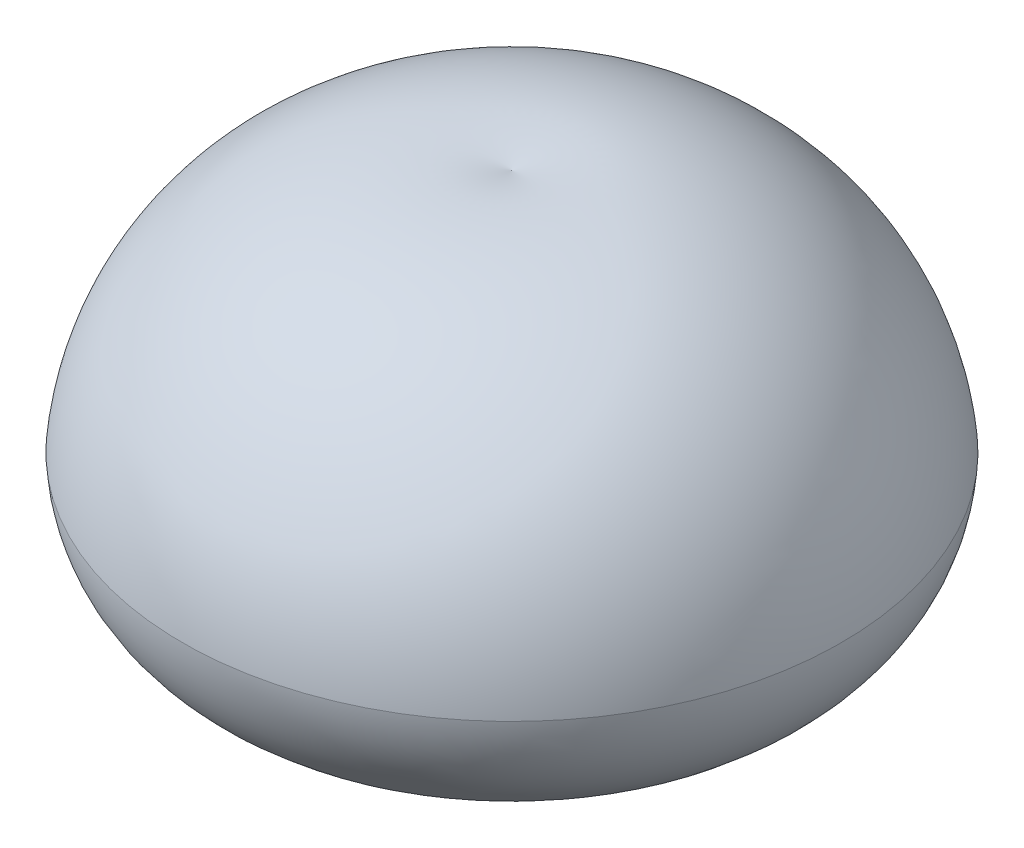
ISO-10303-21;
HEADER;
FILE_DESCRIPTION(('STEP AP214'),'2;1');
FILE_NAME('part.step','',(''),(''),'','','');
FILE_SCHEMA(('AUTOMOTIVE_DESIGN { 1 0 10303 214 1 1 1 1 }'));
ENDSEC;
DATA;
#1=APPLICATION_CONTEXT('core data for automotive mechanical design processes');
#2=APPLICATION_PROTOCOL_DEFINITION('international standard','automotive_design',2000,#1);
#3=PRODUCT_CONTEXT('',#1,'mechanical');
#4=PRODUCT('Part','Part','',(#3));
#5=PRODUCT_RELATED_PRODUCT_CATEGORY('part','',(#4));
#6=PRODUCT_DEFINITION_FORMATION('','',#4);
#7=PRODUCT_DEFINITION_CONTEXT('part definition',#1,'design');
#8=PRODUCT_DEFINITION('design','',#6,#7);
#9=PRODUCT_DEFINITION_SHAPE('','',#8);
#10=(LENGTH_UNIT() NAMED_UNIT(*) SI_UNIT(.MILLI.,.METRE.));
#11=(NAMED_UNIT(*) PLANE_ANGLE_UNIT() SI_UNIT($,.RADIAN.));
#12=(NAMED_UNIT(*) SI_UNIT($,.STERADIAN.) SOLID_ANGLE_UNIT());
#13=UNCERTAINTY_MEASURE_WITH_UNIT(LENGTH_MEASURE(1.E-05),#10,'distance_accuracy_value','');
#14=(GEOMETRIC_REPRESENTATION_CONTEXT(3) GLOBAL_UNCERTAINTY_ASSIGNED_CONTEXT((#13)) GLOBAL_UNIT_ASSIGNED_CONTEXT((#10,
#11,#12)) REPRESENTATION_CONTEXT('',''));
#15=CARTESIAN_POINT('',(0.,0.,0.));
#16=DIRECTION('',(0.,0.,1.));
#17=DIRECTION('',(1.,0.,0.));
#18=AXIS2_PLACEMENT_3D('',#15,#16,#17);
#19=CARTESIAN_POINT('',(0.,1140.,0.));
#20=DIRECTION('',(0.,-1.,0.));
#21=DIRECTION('',(0.,0.,-1.));
#22=AXIS2_PLACEMENT_3D('',#19,#20,#21);
#23=DEGENERATE_TOROIDAL_SURFACE('',#22,460.,720.30199018,.T.);
#24=CARTESIAN_POINT('',(0.,1847.18561288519,0.));
#25=DIRECTION('',(0.,-1.,0.));
#26=DIRECTION('',(0.,0.,-1.));
#27=AXIS2_PLACEMENT_3D('',#24,#25,#26);
#28=CIRCLE('',#27,596.833716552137);
#29=CARTESIAN_POINT('',(0.,1847.18561288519,-596.833716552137));
#30=VERTEX_POINT('',#29);
#31=EDGE_CURVE('E10',#30,#30,#28,.T.);
#32=ORIENTED_EDGE('',*,*,#31,.F.);
#33=EDGE_LOOP('',(#32));
#34=FACE_BOUND('',#33,.T.);
#35=CARTESIAN_POINT('',(0.,459.14243577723,0.));
#36=DIRECTION('',(0.,-1.,0.));
#37=DIRECTION('',(0.,0.,-1.));
#38=AXIS2_PLACEMENT_3D('',#35,#36,#37);
#39=CIRCLE('',#38,695.091331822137);
#40=CARTESIAN_POINT('',(0.,459.14243577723,-695.091331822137));
#41=VERTEX_POINT('',#40);
#42=EDGE_CURVE('E38',#41,#41,#39,.T.);
#43=ORIENTED_EDGE('',*,*,#42,.T.);
#44=EDGE_LOOP('',(#43));
#45=FACE_BOUND('',#44,.T.);
#46=ADVANCED_FACE('F15',(#34,#45),#23,.F.);
#47=CARTESIAN_POINT('',(0.,1411.75999736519,554.222117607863));
#48=DIRECTION('',(-1.,0.,0.));
#49=DIRECTION('',(0.,0.,-1.));
#50=AXIS2_PLACEMENT_3D('',#47,#48,#49);
#51=CIRCLE('',#50,1230.66039182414);
#52=TRIMMED_CURVE('',#51,(PARAMETER_VALUE(-1.10364429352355)),
(PARAMETER_VALUE(1.10364429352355)),.T.,.PARAMETER.);
#53=CARTESIAN_POINT('',(0.,1411.75999736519,0.));
#54=DIRECTION('',(0.,-1.,0.));
#55=AXIS1_PLACEMENT('',#53,#54);
#56=SURFACE_OF_REVOLUTION('',#52,#55);
#57=CARTESIAN_POINT('',(1.11022302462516E-13,2510.56063640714,0.));
#58=VERTEX_POINT('',#57);
#59=VERTEX_LOOP('',#58);
#60=FACE_BOUND('',#59,.T.);
#61=ORIENTED_EDGE('',*,*,#31,.T.);
#62=EDGE_LOOP('',(#61));
#63=FACE_BOUND('',#62,.T.);
#64=ADVANCED_FACE('F28',(#60,#63),#56,.F.);
#65=CARTESIAN_POINT('',(0.,1140.,-460.));
#66=DIRECTION('',(-1.,0.,0.));
#67=DIRECTION('',(0.,0.,-1.));
#68=AXIS2_PLACEMENT_3D('',#65,#66,#67);
#69=CIRCLE('',#68,2251.88860388);
#70=TRIMMED_CURVE('',#69,(PARAMETER_VALUE(-1.77651729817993)),
(PARAMETER_VALUE(1.77651729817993)),.T.,.PARAMETER.);
#71=CARTESIAN_POINT('',(0.,1140.,0.));
#72=DIRECTION('',(0.,-1.,0.));
#73=AXIS1_PLACEMENT('',#71,#72);
#74=SURFACE_OF_REVOLUTION('',#70,#73);
#75=CARTESIAN_POINT('',(0.,1341.3645045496,0.));
#76=DIRECTION('',(0.,-1.,0.));
#77=DIRECTION('',(0.,0.,-1.));
#78=AXIS2_PLACEMENT_3D('',#75,#76,#77);
#79=CIRCLE('',#78,2702.86749956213);
#80=CARTESIAN_POINT('',(0.,1341.3645045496,-2702.86749956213));
#81=VERTEX_POINT('',#80);
#82=EDGE_CURVE('E22',#81,#81,#79,.T.);
#83=ORIENTED_EDGE('',*,*,#82,.F.);
#84=EDGE_LOOP('',(#83));
#85=FACE_BOUND('',#84,.T.);
#86=CARTESIAN_POINT('',(0.,3344.40519965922,0.));
#87=VERTEX_POINT('',#86);
#88=VERTEX_LOOP('',#87);
#89=FACE_BOUND('',#88,.T.);
#90=ADVANCED_FACE('F31',(#85,#89),#74,.T.);
#91=CARTESIAN_POINT('',(0.,1411.75999735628,0.));
#92=DIRECTION('',(0.,-1.,0.));
#93=DIRECTION('',(0.,0.,-1.));
#94=AXIS2_PLACEMENT_3D('',#91,#92,#93);
#95=TOROIDAL_SURFACE('',#94,1474.22211761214,1230.66039182);
#96=ORIENTED_EDGE('',*,*,#42,.F.);
#97=EDGE_LOOP('',(#96));
#98=FACE_BOUND('',#97,.T.);
#99=ORIENTED_EDGE('',*,*,#82,.T.);
#100=EDGE_LOOP('',(#99));
#101=FACE_BOUND('',#100,.T.);
#102=ADVANCED_FACE('F44',(#98,#101),#95,.T.);
#103=CLOSED_SHELL('',(#46,#64,#90,#102));
#104=MANIFOLD_SOLID_BREP('B1',#103);
#105=ADVANCED_BREP_SHAPE_REPRESENTATION('',(#18,#104),#14);
#106=SHAPE_DEFINITION_REPRESENTATION(#9,#105);
ENDSEC;
END-ISO-10303-21;
